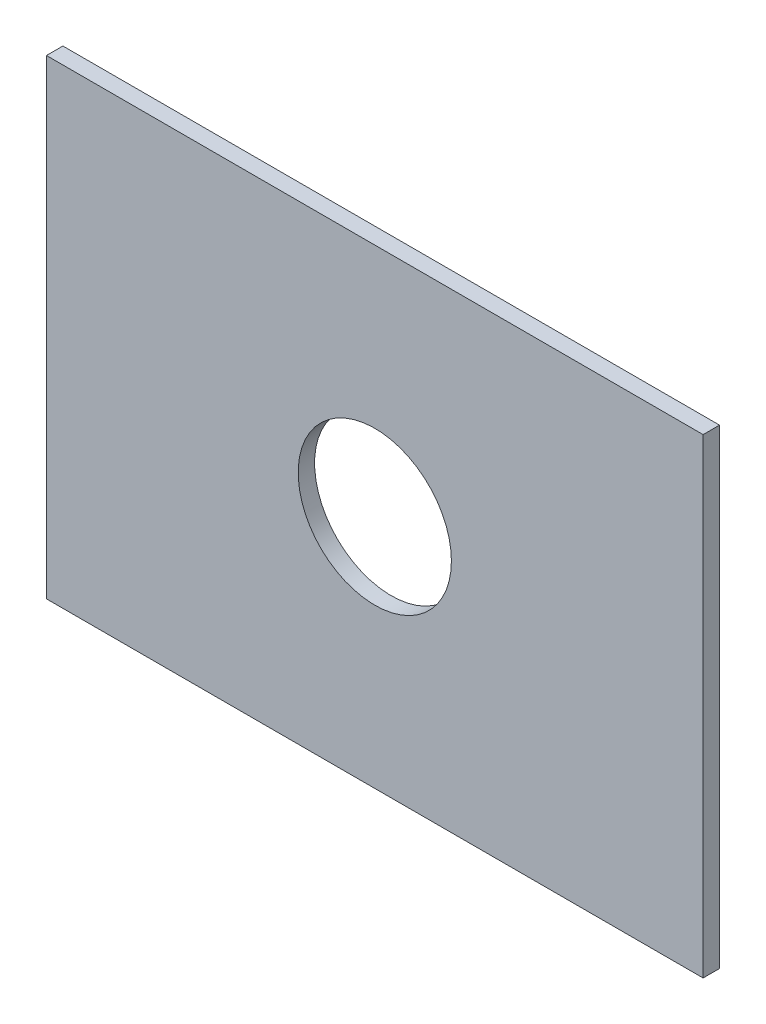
from build123d import *

# Parameters (mm, degrees)
CROQUIS1_W              = 600
CROQUIS1_H              = 430
SALIENTE_EXTRUIR1_DEPTH = 15
CROQUIS2_R              = 70
CORTAR_EXTRUIR1_DEPTH   = 15


with BuildPart() as part:
    # Croquis1 → Saliente-Extruir1 (new body)
    with BuildSketch(Plane.XY):
        Rectangle(CROQUIS1_W, CROQUIS1_H)
    extrude(amount=SALIENTE_EXTRUIR1_DEPTH)

    # Croquis2 → Cortar-Extruir1 (cut)
    with BuildSketch(Plane.XY.offset(15)):
        Circle(CROQUIS2_R)
    extrude(amount=-CORTAR_EXTRUIR1_DEPTH, mode=Mode.SUBTRACT)


solid = part.part
